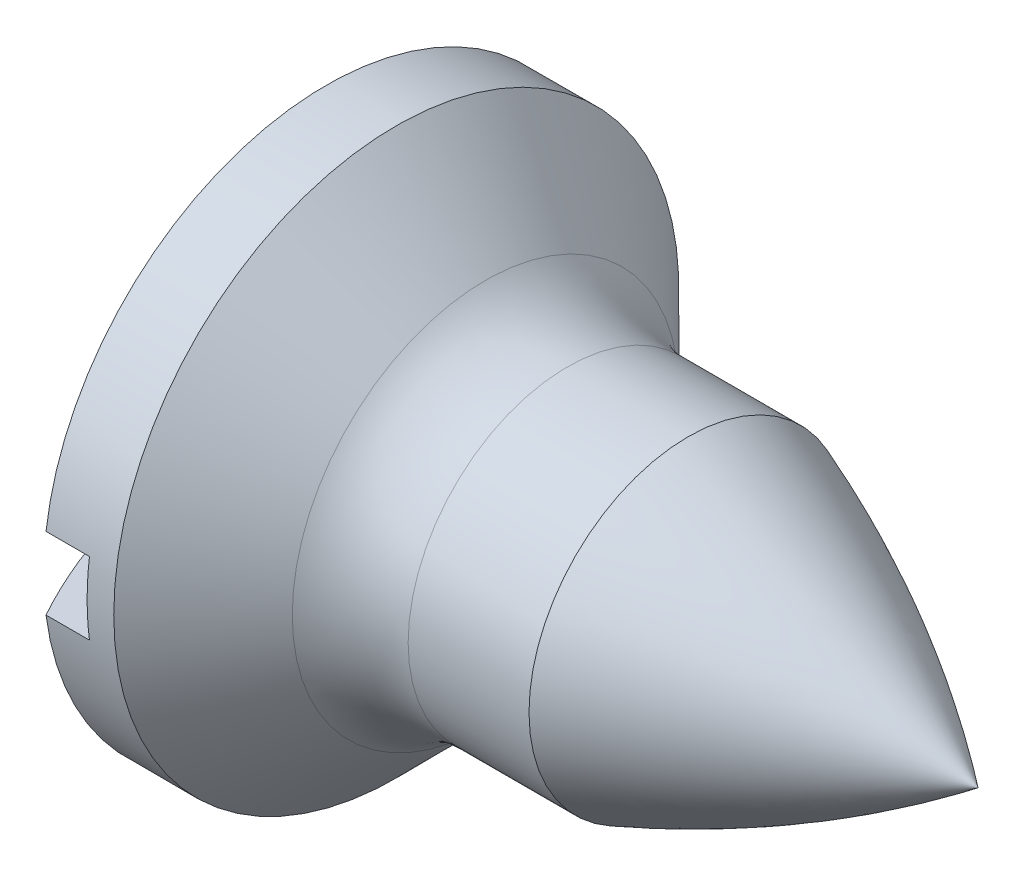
ISO-10303-21;
HEADER;
FILE_DESCRIPTION(('STEP AP214'),'2;1');
FILE_NAME('part.step','',(''),(''),'','','');
FILE_SCHEMA(('AUTOMOTIVE_DESIGN { 1 0 10303 214 1 1 1 1 }'));
ENDSEC;
DATA;
#1=APPLICATION_CONTEXT('core data for automotive mechanical design processes');
#2=APPLICATION_PROTOCOL_DEFINITION('international standard','automotive_design',2000,#1);
#3=PRODUCT_CONTEXT('',#1,'mechanical');
#4=PRODUCT('Part','Part','',(#3));
#5=PRODUCT_RELATED_PRODUCT_CATEGORY('part','',(#4));
#6=PRODUCT_DEFINITION_FORMATION('','',#4);
#7=PRODUCT_DEFINITION_CONTEXT('part definition',#1,'design');
#8=PRODUCT_DEFINITION('design','',#6,#7);
#9=PRODUCT_DEFINITION_SHAPE('','',#8);
#10=(LENGTH_UNIT() NAMED_UNIT(*) SI_UNIT(.MILLI.,.METRE.));
#11=(NAMED_UNIT(*) PLANE_ANGLE_UNIT() SI_UNIT($,.RADIAN.));
#12=(NAMED_UNIT(*) SI_UNIT($,.STERADIAN.) SOLID_ANGLE_UNIT());
#13=UNCERTAINTY_MEASURE_WITH_UNIT(LENGTH_MEASURE(1.E-05),#10,'distance_accuracy_value','');
#14=(GEOMETRIC_REPRESENTATION_CONTEXT(3) GLOBAL_UNCERTAINTY_ASSIGNED_CONTEXT((#13)) GLOBAL_UNIT_ASSIGNED_CONTEXT((#10,
#11,#12)) REPRESENTATION_CONTEXT('',''));
#15=CARTESIAN_POINT('',(0.,0.,0.));
#16=DIRECTION('',(0.,0.,1.));
#17=DIRECTION('',(1.,0.,0.));
#18=AXIS2_PLACEMENT_3D('',#15,#16,#17);
#19=CARTESIAN_POINT('',(-40.19447010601,0.,0.));
#20=DIRECTION('',(-1.,0.,0.));
#21=DIRECTION('',(0.,0.,1.));
#22=AXIS2_PLACEMENT_3D('',#19,#20,#21);
#23=CYLINDRICAL_SURFACE('',#22,1.1);
#24=CARTESIAN_POINT('',(2.17350556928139,0.,0.));
#25=DIRECTION('',(-1.,0.,0.));
#26=DIRECTION('',(0.,0.,1.));
#27=AXIS2_PLACEMENT_3D('',#24,#25,#26);
#28=CIRCLE('',#27,1.1);
#29=CARTESIAN_POINT('',(2.17350556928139,0.,1.1));
#30=VERTEX_POINT('',#29);
#31=EDGE_CURVE('E140',#30,#30,#28,.T.);
#32=ORIENTED_EDGE('',*,*,#31,.F.);
#33=EDGE_LOOP('',(#32));
#34=FACE_BOUND('',#33,.T.);
#35=CARTESIAN_POINT('',(3.00782014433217,0.,0.));
#36=DIRECTION('',(1.,0.,0.));
#37=DIRECTION('',(0.,1.,0.));
#38=AXIS2_PLACEMENT_3D('',#35,#36,#37);
#39=CIRCLE('',#38,1.1);
#40=CARTESIAN_POINT('',(3.00782014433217,1.09999999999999,0.));
#41=VERTEX_POINT('',#40);
#42=EDGE_CURVE('E155',#41,#41,#39,.T.);
#43=ORIENTED_EDGE('',*,*,#42,.F.);
#44=EDGE_LOOP('',(#43));
#45=FACE_BOUND('',#44,.T.);
#46=ADVANCED_FACE('F36',(#34,#45),#23,.T.);
#47=CARTESIAN_POINT('',(4.,0.,0.));
#48=DIRECTION('',(-1.,0.,0.));
#49=DIRECTION('',(0.,1.,0.));
#50=AXIS2_PLACEMENT_3D('',#47,#48,#49);
#51=SPHERICAL_SURFACE('',#50,4.);
#52=CARTESIAN_POINT('',(4.,0.249999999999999,0.));
#53=DIRECTION('',(0.,1.,0.));
#54=DIRECTION('',(-1.,0.,0.));
#55=AXIS2_PLACEMENT_3D('',#52,#53,#54);
#56=CIRCLE('',#55,3.99217985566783);
#57=CARTESIAN_POINT('',(0.50782014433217,0.249999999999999,-1.93447146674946));
#58=VERTEX_POINT('',#57);
#59=CARTESIAN_POINT('',(0.50782014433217,0.250000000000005,1.93447146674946));
#60=VERTEX_POINT('',#59);
#61=EDGE_CURVE('E59',#58,#60,#56,.T.);
#62=ORIENTED_EDGE('',*,*,#61,.T.);
#63=CARTESIAN_POINT('',(0.50782014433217,0.,0.));
#64=DIRECTION('',(-1.,0.,0.));
#65=DIRECTION('',(0.,0.,1.));
#66=AXIS2_PLACEMENT_3D('',#63,#64,#65);
#67=CIRCLE('',#66,1.9505588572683);
#68=EDGE_CURVE('E131',#60,#58,#67,.T.);
#69=ORIENTED_EDGE('',*,*,#68,.T.);
#70=EDGE_LOOP('',(#62,#69));
#71=FACE_BOUND('',#70,.T.);
#72=ADVANCED_FACE('F92',(#71),#51,.T.);
#73=CARTESIAN_POINT('',(2.17350556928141,0.,0.));
#74=DIRECTION('',(-1.,0.,0.));
#75=DIRECTION('',(0.,0.,1.));
#76=AXIS2_PLACEMENT_3D('',#73,#74,#75);
#77=TOROIDAL_SURFACE('',#76,1.9,0.800000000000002);
#78=CARTESIAN_POINT('',(1.60782014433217,0.,0.));
#79=DIRECTION('',(-1.,0.,0.));
#80=DIRECTION('',(0.,0.,1.));
#81=AXIS2_PLACEMENT_3D('',#78,#79,#80);
#82=CIRCLE('',#81,1.33431457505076);
#83=CARTESIAN_POINT('',(1.60782014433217,0.,1.33431457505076));
#84=VERTEX_POINT('',#83);
#85=EDGE_CURVE('E150',#84,#84,#82,.T.);
#86=ORIENTED_EDGE('',*,*,#85,.F.);
#87=EDGE_LOOP('',(#86));
#88=FACE_BOUND('',#87,.T.);
#89=ORIENTED_EDGE('',*,*,#31,.T.);
#90=EDGE_LOOP('',(#89));
#91=FACE_BOUND('',#90,.T.);
#92=ADVANCED_FACE('F38',(#88,#91),#77,.F.);
#93=CARTESIAN_POINT('',(0.50782014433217,-0.250000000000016,-1.93447146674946));
#94=VERTEX_POINT('',#93);
#95=CARTESIAN_POINT('',(0.50782014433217,-0.25,1.93447146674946));
#96=VERTEX_POINT('',#95);
#97=EDGE_CURVE('E143',#94,#96,#67,.T.);
#98=ORIENTED_EDGE('',*,*,#97,.T.);
#99=CARTESIAN_POINT('',(4.,-0.249999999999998,0.));
#100=DIRECTION('',(0.,-1.,0.));
#101=DIRECTION('',(1.,0.,0.));
#102=AXIS2_PLACEMENT_3D('',#99,#100,#101);
#103=CIRCLE('',#102,3.99217985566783);
#104=EDGE_CURVE('E124',#96,#94,#103,.T.);
#105=ORIENTED_EDGE('',*,*,#104,.T.);
#106=EDGE_LOOP('',(#98,#105));
#107=FACE_BOUND('',#106,.T.);
#108=ADVANCED_FACE('F99',(#107),#51,.T.);
#109=CARTESIAN_POINT('',(-40.19447010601,0.,0.));
#110=DIRECTION('',(-1.,0.,0.));
#111=DIRECTION('',(0.,0.,1.));
#112=AXIS2_PLACEMENT_3D('',#109,#110,#111);
#113=CYLINDRICAL_SURFACE('',#112,1.9505588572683);
#114=CARTESIAN_POINT('',(0.807820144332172,0.,0.));
#115=DIRECTION('',(1.,0.,0.));
#116=DIRECTION('',(0.,0.,-1.));
#117=AXIS2_PLACEMENT_3D('',#114,#115,#116);
#118=CIRCLE('',#117,1.9505588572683);
#119=CARTESIAN_POINT('',(0.807820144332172,-0.249999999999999,-1.93447146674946));
#120=VERTEX_POINT('',#119);
#121=CARTESIAN_POINT('',(0.807820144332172,0.249999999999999,-1.93447146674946));
#122=VERTEX_POINT('',#121);
#123=EDGE_CURVE('E134',#120,#122,#118,.T.);
#124=ORIENTED_EDGE('',*,*,#123,.T.);
#125=DIRECTION('',(-1.,0.,0.));
#126=VECTOR('',#125,1.);
#127=CARTESIAN_POINT('',(-40.19447010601,0.250000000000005,-1.93447146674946));
#128=LINE('',#127,#126);
#129=EDGE_CURVE('E11',#122,#58,#128,.T.);
#130=ORIENTED_EDGE('',*,*,#129,.T.);
#131=ORIENTED_EDGE('',*,*,#68,.F.);
#132=DIRECTION('',(-1.,0.,0.));
#133=VECTOR('',#132,1.);
#134=CARTESIAN_POINT('',(-40.19447010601,0.250000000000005,1.93447146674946));
#135=LINE('',#134,#133);
#136=CARTESIAN_POINT('',(0.807820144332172,0.249999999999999,1.93447146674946));
#137=VERTEX_POINT('',#136);
#138=EDGE_CURVE('E44',#60,#137,#135,.F.);
#139=ORIENTED_EDGE('',*,*,#138,.T.);
#140=CARTESIAN_POINT('',(0.807820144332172,-0.249999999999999,1.93447146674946));
#141=VERTEX_POINT('',#140);
#142=EDGE_CURVE('E129',#137,#141,#118,.T.);
#143=ORIENTED_EDGE('',*,*,#142,.T.);
#144=DIRECTION('',(-1.,0.,0.));
#145=VECTOR('',#144,1.);
#146=CARTESIAN_POINT('',(-40.19447010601,-0.250000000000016,1.93447146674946));
#147=LINE('',#146,#145);
#148=EDGE_CURVE('E137',#141,#96,#147,.T.);
#149=ORIENTED_EDGE('',*,*,#148,.T.);
#150=ORIENTED_EDGE('',*,*,#97,.F.);
#151=DIRECTION('',(-1.,0.,0.));
#152=VECTOR('',#151,1.);
#153=CARTESIAN_POINT('',(-40.19447010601,-0.250000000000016,-1.93447146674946));
#154=LINE('',#153,#152);
#155=EDGE_CURVE('E132',#94,#120,#154,.F.);
#156=ORIENTED_EDGE('',*,*,#155,.T.);
#157=EDGE_LOOP('',(#124,#130,#131,#139,#143,#149,#150,#156));
#158=FACE_BOUND('',#157,.T.);
#159=CARTESIAN_POINT('',(0.991575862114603,0.,0.));
#160=DIRECTION('',(-1.,0.,0.));
#161=DIRECTION('',(0.,0.,1.));
#162=AXIS2_PLACEMENT_3D('',#159,#160,#161);
#163=CIRCLE('',#162,1.9505588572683);
#164=CARTESIAN_POINT('',(0.991575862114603,0.,1.9505588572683));
#165=VERTEX_POINT('',#164);
#166=EDGE_CURVE('E146',#165,#165,#163,.T.);
#167=ORIENTED_EDGE('',*,*,#166,.T.);
#168=EDGE_LOOP('',(#167));
#169=FACE_BOUND('',#168,.T.);
#170=ADVANCED_FACE('F104',(#158,#169),#113,.T.);
#171=CARTESIAN_POINT('',(1.60782014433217,0.,0.));
#172=DIRECTION('',(-1.,0.,0.));
#173=DIRECTION('',(0.,0.,1.));
#174=AXIS2_PLACEMENT_3D('',#171,#172,#173);
#175=CONICAL_SURFACE('',#174,1.33431457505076,0.785398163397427);
#176=ORIENTED_EDGE('',*,*,#166,.F.);
#177=EDGE_LOOP('',(#176));
#178=FACE_BOUND('',#177,.T.);
#179=ORIENTED_EDGE('',*,*,#85,.T.);
#180=EDGE_LOOP('',(#179));
#181=FACE_BOUND('',#180,.T.);
#182=ADVANCED_FACE('F108',(#178,#181),#175,.T.);
#183=CARTESIAN_POINT('',(0.00782014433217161,0.249999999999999,-1.9505588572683));
#184=DIRECTION('',(0.,1.,0.));
#185=DIRECTION('',(-1.,0.,0.));
#186=AXIS2_PLACEMENT_3D('',#183,#184,#185);
#187=PLANE('',#186);
#188=DIRECTION('',(0.,0.,1.));
#189=VECTOR('',#188,1.);
#190=CARTESIAN_POINT('',(0.807820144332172,0.249999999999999,-1.9505588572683));
#191=LINE('',#190,#189);
#192=EDGE_CURVE('E121',#122,#137,#191,.T.);
#193=ORIENTED_EDGE('',*,*,#192,.T.);
#194=ORIENTED_EDGE('',*,*,#138,.F.);
#195=ORIENTED_EDGE('',*,*,#61,.F.);
#196=ORIENTED_EDGE('',*,*,#129,.F.);
#197=EDGE_LOOP('',(#193,#194,#195,#196));
#198=FACE_BOUND('',#197,.T.);
#199=ADVANCED_FACE('F111',(#198),#187,.F.);
#200=CARTESIAN_POINT('',(0.807820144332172,0.249999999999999,-1.9505588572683));
#201=DIRECTION('',(1.,0.,0.));
#202=DIRECTION('',(0.,0.,-1.));
#203=AXIS2_PLACEMENT_3D('',#200,#201,#202);
#204=PLANE('',#203);
#205=ORIENTED_EDGE('',*,*,#192,.F.);
#206=ORIENTED_EDGE('',*,*,#123,.F.);
#207=DIRECTION('',(0.,0.,1.));
#208=VECTOR('',#207,1.);
#209=CARTESIAN_POINT('',(0.807820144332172,-0.249999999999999,-1.9505588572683));
#210=LINE('',#209,#208);
#211=EDGE_CURVE('E51',#120,#141,#210,.T.);
#212=ORIENTED_EDGE('',*,*,#211,.T.);
#213=ORIENTED_EDGE('',*,*,#142,.F.);
#214=EDGE_LOOP('',(#205,#206,#212,#213));
#215=FACE_BOUND('',#214,.T.);
#216=ADVANCED_FACE('F87',(#215),#204,.F.);
#217=CARTESIAN_POINT('',(0.00782014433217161,-0.25,-1.9505588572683));
#218=DIRECTION('',(0.,-1.,0.));
#219=DIRECTION('',(1.,0.,0.));
#220=AXIS2_PLACEMENT_3D('',#217,#218,#219);
#221=PLANE('',#220);
#222=ORIENTED_EDGE('',*,*,#211,.F.);
#223=ORIENTED_EDGE('',*,*,#155,.F.);
#224=ORIENTED_EDGE('',*,*,#104,.F.);
#225=ORIENTED_EDGE('',*,*,#148,.F.);
#226=EDGE_LOOP('',(#222,#223,#224,#225));
#227=FACE_BOUND('',#226,.T.);
#228=ADVANCED_FACE('F81',(#227),#221,.F.);
#229=CARTESIAN_POINT('',(0.191903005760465,-6.38803116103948,0.));
#230=DIRECTION('',(0.,0.,-1.));
#231=DIRECTION('',(0.,1.,0.));
#232=AXIS2_PLACEMENT_3D('',#229,#230,#231);
#233=CIRCLE('',#232,8.);
#234=TRIMMED_CURVE('',#233,(PARAMETER_VALUE(-0.645990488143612)),
(PARAMETER_VALUE(0.645990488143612)),.T.,.PARAMETER.);
#235=CARTESIAN_POINT('',(0.191903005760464,0.,0.));
#236=DIRECTION('',(1.,0.,0.));
#237=AXIS1_PLACEMENT('',#235,#236);
#238=SURFACE_OF_REVOLUTION('',#234,#237);
#239=ORIENTED_EDGE('',*,*,#42,.T.);
#240=EDGE_LOOP('',(#239));
#241=FACE_BOUND('',#240,.T.);
#242=CARTESIAN_POINT('',(5.00782014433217,0.,0.));
#243=VERTEX_POINT('',#242);
#244=VERTEX_LOOP('',#243);
#245=FACE_BOUND('',#244,.T.);
#246=ADVANCED_FACE('F79',(#241,#245),#238,.T.);
#247=CLOSED_SHELL('',(#46,#72,#92,#108,#170,#182,#199,#216,#228,#246));
#248=MANIFOLD_SOLID_BREP('B2',#247);
#249=ADVANCED_BREP_SHAPE_REPRESENTATION('',(#18,#248),#14);
#250=SHAPE_DEFINITION_REPRESENTATION(#9,#249);
ENDSEC;
END-ISO-10303-21;
